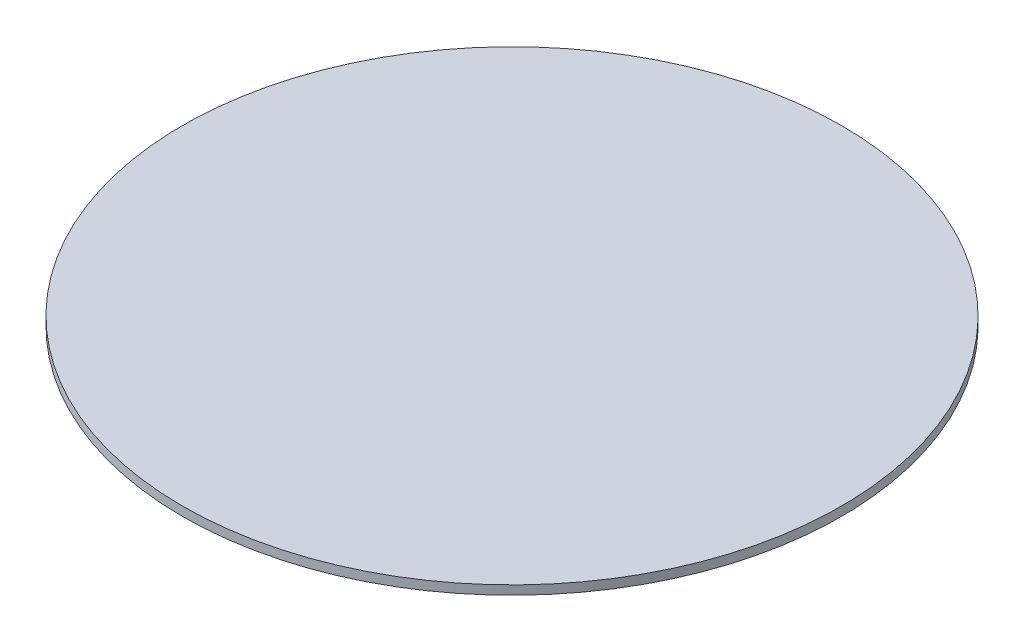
ISO-10303-21;
HEADER;
FILE_DESCRIPTION(('STEP AP214'),'2;1');
FILE_NAME('part.step','',(''),(''),'','','');
FILE_SCHEMA(('AUTOMOTIVE_DESIGN { 1 0 10303 214 1 1 1 1 }'));
ENDSEC;
DATA;
#1=APPLICATION_CONTEXT('core data for automotive mechanical design processes');
#2=APPLICATION_PROTOCOL_DEFINITION('international standard','automotive_design',2000,#1);
#3=PRODUCT_CONTEXT('',#1,'mechanical');
#4=PRODUCT('Part','Part','',(#3));
#5=PRODUCT_RELATED_PRODUCT_CATEGORY('part','',(#4));
#6=PRODUCT_DEFINITION_FORMATION('','',#4);
#7=PRODUCT_DEFINITION_CONTEXT('part definition',#1,'design');
#8=PRODUCT_DEFINITION('design','',#6,#7);
#9=PRODUCT_DEFINITION_SHAPE('','',#8);
#10=(LENGTH_UNIT() NAMED_UNIT(*) SI_UNIT(.MILLI.,.METRE.));
#11=(NAMED_UNIT(*) PLANE_ANGLE_UNIT() SI_UNIT($,.RADIAN.));
#12=(NAMED_UNIT(*) SI_UNIT($,.STERADIAN.) SOLID_ANGLE_UNIT());
#13=UNCERTAINTY_MEASURE_WITH_UNIT(LENGTH_MEASURE(1.E-05),#10,'distance_accuracy_value','');
#14=(GEOMETRIC_REPRESENTATION_CONTEXT(3) GLOBAL_UNCERTAINTY_ASSIGNED_CONTEXT((#13)) GLOBAL_UNIT_ASSIGNED_CONTEXT((#10,
#11,#12)) REPRESENTATION_CONTEXT('',''));
#15=CARTESIAN_POINT('',(0.,0.,0.));
#16=DIRECTION('',(0.,0.,1.));
#17=DIRECTION('',(1.,0.,0.));
#18=AXIS2_PLACEMENT_3D('',#15,#16,#17);
#19=CARTESIAN_POINT('',(8.37955521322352E-13,0.,80.));
#20=DIRECTION('',(0.,1.,0.));
#21=DIRECTION('',(1.,0.,0.));
#22=AXIS2_PLACEMENT_3D('',#19,#20,#21);
#23=CONICAL_SURFACE('',#22,11.,0.0872664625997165);
#24=CARTESIAN_POINT('',(8.37955521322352E-13,-14.0871557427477,80.));
#25=DIRECTION('',(0.,1.,0.));
#26=DIRECTION('',(-1.,0.,0.));
#27=AXIS2_PLACEMENT_3D('',#24,#25,#26);
#28=CIRCLE('',#27,9.76753357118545);
#29=CARTESIAN_POINT('',(-9.76753357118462,-14.0871557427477,80.0000000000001));
#30=VERTEX_POINT('',#29);
#31=EDGE_CURVE('E11',#30,#30,#28,.T.);
#32=ORIENTED_EDGE('',*,*,#31,.T.);
#33=EDGE_LOOP('',(#32));
#34=FACE_BOUND('',#33,.T.);
#35=CARTESIAN_POINT('',(8.37955521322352E-13,0.,80.));
#36=DIRECTION('',(0.,-1.,0.));
#37=DIRECTION('',(1.,0.,0.));
#38=AXIS2_PLACEMENT_3D('',#35,#36,#37);
#39=CIRCLE('',#38,11.);
#40=CARTESIAN_POINT('',(11.0000000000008,0.,79.9999999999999));
#41=VERTEX_POINT('',#40);
#42=EDGE_CURVE('E51',#41,#41,#39,.T.);
#43=ORIENTED_EDGE('',*,*,#42,.T.);
#44=EDGE_LOOP('',(#43));
#45=FACE_BOUND('',#44,.T.);
#46=ADVANCED_FACE('F40',(#34,#45),#23,.T.);
#47=CARTESIAN_POINT('',(8.37955521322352E-13,-15.,80.));
#48=DIRECTION('',(0.,-1.,0.));
#49=DIRECTION('',(1.,0.,0.));
#50=AXIS2_PLACEMENT_3D('',#47,#48,#49);
#51=PLANE('',#50);
#52=CARTESIAN_POINT('',(8.37955521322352E-13,-15.,80.));
#53=DIRECTION('',(0.,-1.,0.));
#54=DIRECTION('',(1.,0.,0.));
#55=AXIS2_PLACEMENT_3D('',#52,#53,#54);
#56=CIRCLE('',#55,8.77133887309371);
#57=CARTESIAN_POINT('',(8.77133887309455,-15.,79.9999999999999));
#58=VERTEX_POINT('',#57);
#59=EDGE_CURVE('E47',#58,#58,#56,.T.);
#60=ORIENTED_EDGE('',*,*,#59,.T.);
#61=EDGE_LOOP('',(#60));
#62=FACE_BOUND('',#61,.T.);
#63=ADVANCED_FACE('F61',(#62),#51,.T.);
#64=CARTESIAN_POINT('',(8.37955521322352E-13,0.,80.));
#65=DIRECTION('',(0.,-1.,0.));
#66=DIRECTION('',(1.,0.,0.));
#67=AXIS2_PLACEMENT_3D('',#64,#65,#66);
#68=PLANE('',#67);
#69=ORIENTED_EDGE('',*,*,#42,.F.);
#70=EDGE_LOOP('',(#69));
#71=FACE_BOUND('',#70,.T.);
#72=ADVANCED_FACE('F59',(#71),#68,.F.);
#73=CARTESIAN_POINT('',(8.37955521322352E-13,-14.,80.));
#74=DIRECTION('',(0.,-1.,0.));
#75=DIRECTION('',(1.,0.,0.));
#76=AXIS2_PLACEMENT_3D('',#73,#74,#75);
#77=TOROIDAL_SURFACE('',#76,8.77133887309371,1.);
#78=ORIENTED_EDGE('',*,*,#31,.F.);
#79=EDGE_LOOP('',(#78));
#80=FACE_BOUND('',#79,.T.);
#81=ORIENTED_EDGE('',*,*,#59,.F.);
#82=EDGE_LOOP('',(#81));
#83=FACE_BOUND('',#82,.T.);
#84=ADVANCED_FACE('F42',(#80,#83),#77,.T.);
#85=CLOSED_SHELL('',(#46,#63,#72,#84));
#86=MANIFOLD_SOLID_BREP('B2',#85);
#87=CARTESIAN_POINT('',(-80.,0.,0.));
#88=DIRECTION('',(0.,1.,0.));
#89=DIRECTION('',(0.,0.,1.));
#90=AXIS2_PLACEMENT_3D('',#87,#88,#89);
#91=CONICAL_SURFACE('',#90,11.,0.0872664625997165);
#92=CARTESIAN_POINT('',(-80.,-14.0871557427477,0.));
#93=DIRECTION('',(0.,1.,0.));
#94=DIRECTION('',(0.,0.,-1.));
#95=AXIS2_PLACEMENT_3D('',#92,#93,#94);
#96=CIRCLE('',#95,9.76753357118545);
#97=CARTESIAN_POINT('',(-80.,-14.0871557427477,-9.76753357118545));
#98=VERTEX_POINT('',#97);
#99=EDGE_CURVE('E39',#98,#98,#96,.T.);
#100=ORIENTED_EDGE('',*,*,#99,.T.);
#101=EDGE_LOOP('',(#100));
#102=FACE_BOUND('',#101,.T.);
#103=CARTESIAN_POINT('',(-80.,0.,0.));
#104=DIRECTION('',(0.,-1.,0.));
#105=DIRECTION('',(0.,0.,1.));
#106=AXIS2_PLACEMENT_3D('',#103,#104,#105);
#107=CIRCLE('',#106,11.);
#108=CARTESIAN_POINT('',(-80.,0.,11.));
#109=VERTEX_POINT('',#108);
#110=EDGE_CURVE('E115',#109,#109,#107,.T.);
#111=ORIENTED_EDGE('',*,*,#110,.T.);
#112=EDGE_LOOP('',(#111));
#113=FACE_BOUND('',#112,.T.);
#114=ADVANCED_FACE('F104',(#102,#113),#91,.T.);
#115=CARTESIAN_POINT('',(-80.,-15.,0.));
#116=DIRECTION('',(0.,-1.,0.));
#117=DIRECTION('',(0.,0.,1.));
#118=AXIS2_PLACEMENT_3D('',#115,#116,#117);
#119=PLANE('',#118);
#120=CARTESIAN_POINT('',(-80.,-15.,0.));
#121=DIRECTION('',(0.,-1.,0.));
#122=DIRECTION('',(0.,0.,1.));
#123=AXIS2_PLACEMENT_3D('',#120,#121,#122);
#124=CIRCLE('',#123,8.77133887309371);
#125=CARTESIAN_POINT('',(-80.,-15.,8.77133887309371));
#126=VERTEX_POINT('',#125);
#127=EDGE_CURVE('E111',#126,#126,#124,.T.);
#128=ORIENTED_EDGE('',*,*,#127,.T.);
#129=EDGE_LOOP('',(#128));
#130=FACE_BOUND('',#129,.T.);
#131=ADVANCED_FACE('F125',(#130),#119,.T.);
#132=CARTESIAN_POINT('',(-80.,0.,0.));
#133=DIRECTION('',(0.,-1.,0.));
#134=DIRECTION('',(0.,0.,1.));
#135=AXIS2_PLACEMENT_3D('',#132,#133,#134);
#136=PLANE('',#135);
#137=ORIENTED_EDGE('',*,*,#110,.F.);
#138=EDGE_LOOP('',(#137));
#139=FACE_BOUND('',#138,.T.);
#140=ADVANCED_FACE('F123',(#139),#136,.F.);
#141=CARTESIAN_POINT('',(-80.,-14.,0.));
#142=DIRECTION('',(0.,-1.,0.));
#143=DIRECTION('',(0.,0.,1.));
#144=AXIS2_PLACEMENT_3D('',#141,#142,#143);
#145=TOROIDAL_SURFACE('',#144,8.77133887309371,1.);
#146=ORIENTED_EDGE('',*,*,#99,.F.);
#147=EDGE_LOOP('',(#146));
#148=FACE_BOUND('',#147,.T.);
#149=ORIENTED_EDGE('',*,*,#127,.F.);
#150=EDGE_LOOP('',(#149));
#151=FACE_BOUND('',#150,.T.);
#152=ADVANCED_FACE('F106',(#148,#151),#145,.T.);
#153=CLOSED_SHELL('',(#114,#131,#140,#152));
#154=MANIFOLD_SOLID_BREP('B6',#153);
#155=CARTESIAN_POINT('',(-2.79318507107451E-13,0.,-80.));
#156=DIRECTION('',(0.,1.,0.));
#157=DIRECTION('',(-1.,0.,0.));
#158=AXIS2_PLACEMENT_3D('',#155,#156,#157);
#159=CONICAL_SURFACE('',#158,11.,0.0872664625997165);
#160=CARTESIAN_POINT('',(-2.79318507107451E-13,-14.0871557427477,-80.));
#161=DIRECTION('',(0.,1.,0.));
#162=DIRECTION('',(1.,0.,0.));
#163=AXIS2_PLACEMENT_3D('',#160,#161,#162);
#164=CIRCLE('',#163,9.76753357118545);
#165=CARTESIAN_POINT('',(9.76753357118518,-14.0871557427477,-80.));
#166=VERTEX_POINT('',#165);
#167=EDGE_CURVE('E103',#166,#166,#164,.T.);
#168=ORIENTED_EDGE('',*,*,#167,.T.);
#169=EDGE_LOOP('',(#168));
#170=FACE_BOUND('',#169,.T.);
#171=CARTESIAN_POINT('',(-2.79318507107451E-13,0.,-80.));
#172=DIRECTION('',(0.,-1.,0.));
#173=DIRECTION('',(-1.,0.,0.));
#174=AXIS2_PLACEMENT_3D('',#171,#172,#173);
#175=CIRCLE('',#174,11.);
#176=CARTESIAN_POINT('',(-11.0000000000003,0.,-80.));
#177=VERTEX_POINT('',#176);
#178=EDGE_CURVE('E179',#177,#177,#175,.T.);
#179=ORIENTED_EDGE('',*,*,#178,.T.);
#180=EDGE_LOOP('',(#179));
#181=FACE_BOUND('',#180,.T.);
#182=ADVANCED_FACE('F168',(#170,#181),#159,.T.);
#183=CARTESIAN_POINT('',(-2.79318507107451E-13,-15.,-80.));
#184=DIRECTION('',(0.,-1.,0.));
#185=DIRECTION('',(-1.,0.,0.));
#186=AXIS2_PLACEMENT_3D('',#183,#184,#185);
#187=PLANE('',#186);
#188=CARTESIAN_POINT('',(-2.79318507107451E-13,-15.,-80.));
#189=DIRECTION('',(0.,-1.,0.));
#190=DIRECTION('',(-1.,0.,0.));
#191=AXIS2_PLACEMENT_3D('',#188,#189,#190);
#192=CIRCLE('',#191,8.77133887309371);
#193=CARTESIAN_POINT('',(-8.77133887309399,-15.,-80.));
#194=VERTEX_POINT('',#193);
#195=EDGE_CURVE('E175',#194,#194,#192,.T.);
#196=ORIENTED_EDGE('',*,*,#195,.T.);
#197=EDGE_LOOP('',(#196));
#198=FACE_BOUND('',#197,.T.);
#199=ADVANCED_FACE('F189',(#198),#187,.T.);
#200=CARTESIAN_POINT('',(-2.79318507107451E-13,0.,-80.));
#201=DIRECTION('',(0.,-1.,0.));
#202=DIRECTION('',(-1.,0.,0.));
#203=AXIS2_PLACEMENT_3D('',#200,#201,#202);
#204=PLANE('',#203);
#205=ORIENTED_EDGE('',*,*,#178,.F.);
#206=EDGE_LOOP('',(#205));
#207=FACE_BOUND('',#206,.T.);
#208=ADVANCED_FACE('F187',(#207),#204,.F.);
#209=CARTESIAN_POINT('',(-2.79318507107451E-13,-14.,-80.));
#210=DIRECTION('',(0.,-1.,0.));
#211=DIRECTION('',(-1.,0.,0.));
#212=AXIS2_PLACEMENT_3D('',#209,#210,#211);
#213=TOROIDAL_SURFACE('',#212,8.77133887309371,1.);
#214=ORIENTED_EDGE('',*,*,#167,.F.);
#215=EDGE_LOOP('',(#214));
#216=FACE_BOUND('',#215,.T.);
#217=ORIENTED_EDGE('',*,*,#195,.F.);
#218=EDGE_LOOP('',(#217));
#219=FACE_BOUND('',#218,.T.);
#220=ADVANCED_FACE('F170',(#216,#219),#213,.T.);
#221=CLOSED_SHELL('',(#182,#199,#208,#220));
#222=MANIFOLD_SOLID_BREP('B34',#221);
#223=CARTESIAN_POINT('',(80.,0.,0.));
#224=DIRECTION('',(0.,1.,0.));
#225=DIRECTION('',(0.,0.,-1.));
#226=AXIS2_PLACEMENT_3D('',#223,#224,#225);
#227=CONICAL_SURFACE('',#226,11.,0.0872664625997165);
#228=CARTESIAN_POINT('',(80.,-14.0871557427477,0.));
#229=DIRECTION('',(0.,1.,0.));
#230=DIRECTION('',(0.,0.,1.));
#231=AXIS2_PLACEMENT_3D('',#228,#229,#230);
#232=CIRCLE('',#231,9.76753357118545);
#233=CARTESIAN_POINT('',(80.,-14.0871557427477,9.76753357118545));
#234=VERTEX_POINT('',#233);
#235=EDGE_CURVE('E167',#234,#234,#232,.T.);
#236=ORIENTED_EDGE('',*,*,#235,.T.);
#237=EDGE_LOOP('',(#236));
#238=FACE_BOUND('',#237,.T.);
#239=CARTESIAN_POINT('',(80.,0.,0.));
#240=DIRECTION('',(0.,-1.,0.));
#241=DIRECTION('',(0.,0.,-1.));
#242=AXIS2_PLACEMENT_3D('',#239,#240,#241);
#243=CIRCLE('',#242,11.);
#244=CARTESIAN_POINT('',(80.,0.,-11.));
#245=VERTEX_POINT('',#244);
#246=EDGE_CURVE('E242',#245,#245,#243,.T.);
#247=ORIENTED_EDGE('',*,*,#246,.T.);
#248=EDGE_LOOP('',(#247));
#249=FACE_BOUND('',#248,.T.);
#250=ADVANCED_FACE('F231',(#238,#249),#227,.T.);
#251=CARTESIAN_POINT('',(80.,-15.,0.));
#252=DIRECTION('',(0.,-1.,0.));
#253=DIRECTION('',(0.,0.,-1.));
#254=AXIS2_PLACEMENT_3D('',#251,#252,#253);
#255=PLANE('',#254);
#256=CARTESIAN_POINT('',(80.,-15.,0.));
#257=DIRECTION('',(0.,-1.,0.));
#258=DIRECTION('',(0.,0.,-1.));
#259=AXIS2_PLACEMENT_3D('',#256,#257,#258);
#260=CIRCLE('',#259,8.77133887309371);
#261=CARTESIAN_POINT('',(80.,-15.,-8.77133887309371));
#262=VERTEX_POINT('',#261);
#263=EDGE_CURVE('E238',#262,#262,#260,.T.);
#264=ORIENTED_EDGE('',*,*,#263,.T.);
#265=EDGE_LOOP('',(#264));
#266=FACE_BOUND('',#265,.T.);
#267=ADVANCED_FACE('F252',(#266),#255,.T.);
#268=CARTESIAN_POINT('',(80.,0.,0.));
#269=DIRECTION('',(0.,-1.,0.));
#270=DIRECTION('',(0.,0.,-1.));
#271=AXIS2_PLACEMENT_3D('',#268,#269,#270);
#272=PLANE('',#271);
#273=ORIENTED_EDGE('',*,*,#246,.F.);
#274=EDGE_LOOP('',(#273));
#275=FACE_BOUND('',#274,.T.);
#276=ADVANCED_FACE('F250',(#275),#272,.F.);
#277=CARTESIAN_POINT('',(80.,-14.,0.));
#278=DIRECTION('',(0.,-1.,0.));
#279=DIRECTION('',(0.,0.,-1.));
#280=AXIS2_PLACEMENT_3D('',#277,#278,#279);
#281=TOROIDAL_SURFACE('',#280,8.77133887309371,1.);
#282=ORIENTED_EDGE('',*,*,#235,.F.);
#283=EDGE_LOOP('',(#282));
#284=FACE_BOUND('',#283,.T.);
#285=ORIENTED_EDGE('',*,*,#263,.F.);
#286=EDGE_LOOP('',(#285));
#287=FACE_BOUND('',#286,.T.);
#288=ADVANCED_FACE('F233',(#284,#287),#281,.T.);
#289=CLOSED_SHELL('',(#250,#267,#276,#288));
#290=MANIFOLD_SOLID_BREP('B98',#289);
#291=CARTESIAN_POINT('',(0.,3.,0.));
#292=DIRECTION('',(0.,-1.,0.));
#293=DIRECTION('',(0.,0.,-1.));
#294=AXIS2_PLACEMENT_3D('',#291,#292,#293);
#295=CYLINDRICAL_SURFACE('',#294,110.);
#296=CARTESIAN_POINT('',(0.,3.,0.));
#297=DIRECTION('',(0.,1.,0.));
#298=DIRECTION('',(0.,0.,1.));
#299=AXIS2_PLACEMENT_3D('',#296,#297,#298);
#300=CIRCLE('',#299,110.);
#301=CARTESIAN_POINT('',(0.,3.,110.));
#302=VERTEX_POINT('',#301);
#303=EDGE_CURVE('E230',#302,#302,#300,.T.);
#304=ORIENTED_EDGE('',*,*,#303,.F.);
#305=EDGE_LOOP('',(#304));
#306=FACE_BOUND('',#305,.T.);
#307=CARTESIAN_POINT('',(0.,0.,0.));
#308=DIRECTION('',(0.,1.,0.));
#309=DIRECTION('',(0.,0.,1.));
#310=AXIS2_PLACEMENT_3D('',#307,#308,#309);
#311=CIRCLE('',#310,110.);
#312=CARTESIAN_POINT('',(0.,0.,110.));
#313=VERTEX_POINT('',#312);
#314=EDGE_CURVE('E290',#313,#313,#311,.T.);
#315=ORIENTED_EDGE('',*,*,#314,.T.);
#316=EDGE_LOOP('',(#315));
#317=FACE_BOUND('',#316,.T.);
#318=ADVANCED_FACE('F287',(#306,#317),#295,.T.);
#319=CARTESIAN_POINT('',(0.,3.,0.));
#320=DIRECTION('',(0.,1.,0.));
#321=DIRECTION('',(0.,0.,1.));
#322=AXIS2_PLACEMENT_3D('',#319,#320,#321);
#323=PLANE('',#322);
#324=ORIENTED_EDGE('',*,*,#303,.T.);
#325=EDGE_LOOP('',(#324));
#326=FACE_BOUND('',#325,.T.);
#327=ADVANCED_FACE('F302',(#326),#323,.T.);
#328=CARTESIAN_POINT('',(0.,0.,0.));
#329=DIRECTION('',(0.,1.,0.));
#330=DIRECTION('',(0.,0.,1.));
#331=AXIS2_PLACEMENT_3D('',#328,#329,#330);
#332=PLANE('',#331);
#333=ORIENTED_EDGE('',*,*,#314,.F.);
#334=EDGE_LOOP('',(#333));
#335=FACE_BOUND('',#334,.T.);
#336=ADVANCED_FACE('F300',(#335),#332,.F.);
#337=CLOSED_SHELL('',(#318,#327,#336));
#338=MANIFOLD_SOLID_BREP('B162',#337);
#339=ADVANCED_BREP_SHAPE_REPRESENTATION('',(#18,#86,#154,#222,#290,#338),#14);
#340=SHAPE_DEFINITION_REPRESENTATION(#9,#339);
ENDSEC;
END-ISO-10303-21;
